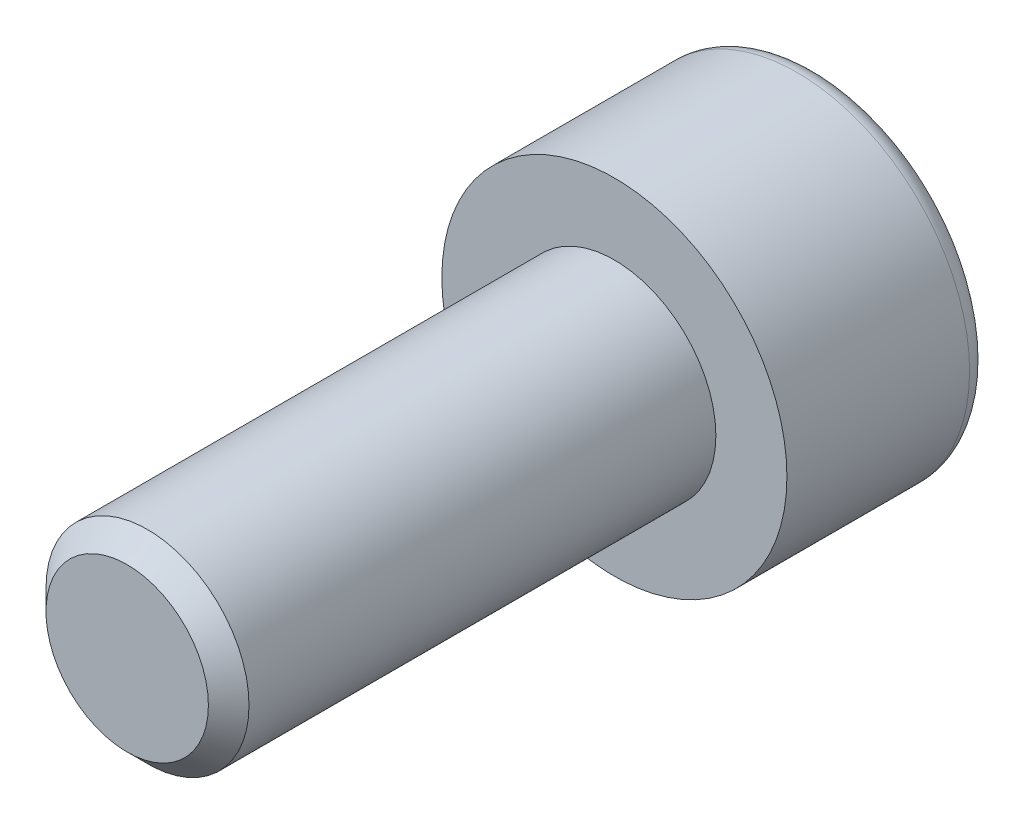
from build123d import *

# Parameters (mm, degrees)
ENLEV_MAT_EXTRU1_DEPTH = 2.5
ESQUISSE3_W            = 2.5
ESQUISSE3_H            = 12
CHANFREIN1_SIZE        = 0.5


with BuildPart() as part:
    # Esquisse1 → Base-R_volution (revolve)
    with BuildSketch(Plane(origin=(0, 0, 0), x_dir=(1, 0, 0), z_dir=(0, 1, 0)), mode=Mode.PRIVATE) as base_r_volution_sk:
        with BuildLine():
            Line((0, 0), (4.25, 0))
            Line((4.25, 0), (4.25, 4.5))
            ThreePointArc((4.25, 4.5), (4.103553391, 4.853553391), (3.75, 5))
            Line((3.75, 5), (0, 5))
            Line((0, 5), (0, 0))
        make_face()
    revolve(base_r_volution_sk.sketch.rotate(Axis((0, 0, 0), (0, 0, -1)), 180), axis=Axis((0, 0, 0), (0, 0, -1)))

    # Esquisse2 → enlev-mat-Extru1 (cut)
    with BuildSketch(Plane.XY.offset(-5)):
        Polygon((2, -1.154700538), (2, 1.154700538), (0, 2.309401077), (-2, 1.154700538), (-2, -1.154700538), (0, -2.309401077), align=None)
    extrude(amount=ENLEV_MAT_EXTRU1_DEPTH, mode=Mode.SUBTRACT)

    # Esquisse3 → Boss.-R_vol.1 (revolve)
    with BuildSketch(Plane(origin=(0, 0, 0), x_dir=(1, 0, 0), z_dir=(0, 1, 0))):
        with Locations((1.25, -6)):
            Rectangle(ESQUISSE3_W, ESQUISSE3_H)
    revolve(axis=Axis((0, 0, 0), (0, 0, 1)))

    # Chanfrein1
    chanfrein1_edges = [part.edges().sort_by_distance(p)[0] for p in [
        (-2.5, 0, 12),
    ]]
    chamfer(chanfrein1_edges, length=CHANFREIN1_SIZE)


solid = part.part
